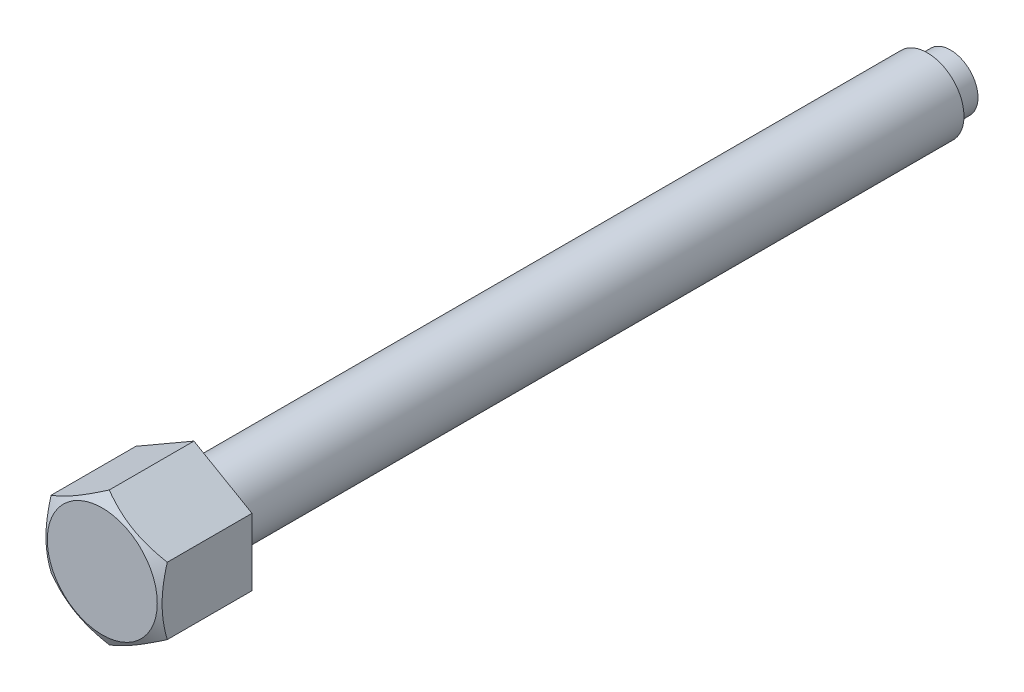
ISO-10303-21;
HEADER;
FILE_DESCRIPTION(('STEP AP214'),'2;1');
FILE_NAME('part.step','',(''),(''),'','','');
FILE_SCHEMA(('AUTOMOTIVE_DESIGN { 1 0 10303 214 1 1 1 1 }'));
ENDSEC;
DATA;
#1=APPLICATION_CONTEXT('core data for automotive mechanical design processes');
#2=APPLICATION_PROTOCOL_DEFINITION('international standard','automotive_design',2000,#1);
#3=PRODUCT_CONTEXT('',#1,'mechanical');
#4=PRODUCT('Part','Part','',(#3));
#5=PRODUCT_RELATED_PRODUCT_CATEGORY('part','',(#4));
#6=PRODUCT_DEFINITION_FORMATION('','',#4);
#7=PRODUCT_DEFINITION_CONTEXT('part definition',#1,'design');
#8=PRODUCT_DEFINITION('design','',#6,#7);
#9=PRODUCT_DEFINITION_SHAPE('','',#8);
#10=(LENGTH_UNIT() NAMED_UNIT(*) SI_UNIT(.MILLI.,.METRE.));
#11=(NAMED_UNIT(*) PLANE_ANGLE_UNIT() SI_UNIT($,.RADIAN.));
#12=(NAMED_UNIT(*) SI_UNIT($,.STERADIAN.) SOLID_ANGLE_UNIT());
#13=UNCERTAINTY_MEASURE_WITH_UNIT(LENGTH_MEASURE(1.E-05),#10,'distance_accuracy_value','');
#14=(GEOMETRIC_REPRESENTATION_CONTEXT(3) GLOBAL_UNCERTAINTY_ASSIGNED_CONTEXT((#13)) GLOBAL_UNIT_ASSIGNED_CONTEXT((#10,
#11,#12)) REPRESENTATION_CONTEXT('',''));
#15=CARTESIAN_POINT('',(0.,0.,0.));
#16=DIRECTION('',(0.,0.,1.));
#17=DIRECTION('',(1.,0.,0.));
#18=AXIS2_PLACEMENT_3D('',#15,#16,#17);
#19=CARTESIAN_POINT('',(0.,10.9696551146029,125.));
#20=DIRECTION('',(-0.5,-0.86602540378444,0.));
#21=DIRECTION('',(0.86602540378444,-0.5,0.));
#22=AXIS2_PLACEMENT_3D('',#19,#20,#21);
#23=PLANE('',#22);
#24=CARTESIAN_POINT('',(9.5002,5.4847120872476,138.862752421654));
#25=CARTESIAN_POINT('',(9.2913692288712,5.60528058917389,138.932351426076));
#26=CARTESIAN_POINT('',(9.08175982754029,5.72629863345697,138.998791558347));
#27=CARTESIAN_POINT('',(8.66086011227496,5.96930519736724,139.124477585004));
#28=CARTESIAN_POINT('',(8.44956926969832,6.09129402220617,139.183721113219));
#29=CARTESIAN_POINT('',(7.81229220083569,6.45922610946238,139.349510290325));
#30=CARTESIAN_POINT('',(7.38379023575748,6.70662183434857,139.443810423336));
#31=CARTESIAN_POINT('',(6.74255666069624,7.0768382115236,139.554386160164));
#32=CARTESIAN_POINT('',(6.53174078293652,7.19855281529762,139.585885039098));
#33=CARTESIAN_POINT('',(6.1091329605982,7.4425455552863,139.638706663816));
#34=CARTESIAN_POINT('',(5.89734099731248,7.5648237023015,139.66002921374));
#35=CARTESIAN_POINT('',(5.47340378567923,7.80958396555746,139.691951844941));
#36=CARTESIAN_POINT('',(5.26125925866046,7.93206566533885,139.702564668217));
#37=CARTESIAN_POINT('',(4.83677424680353,8.17714220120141,139.712842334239));
#38=CARTESIAN_POINT('',(4.62443376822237,8.29973703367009,139.712507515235));
#39=CARTESIAN_POINT('',(4.22745800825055,8.52893109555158,139.701651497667));
#40=CARTESIAN_POINT('',(4.04279470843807,8.63554650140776,139.692454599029));
#41=CARTESIAN_POINT('',(3.67389999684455,8.84852796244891,139.665959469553));
#42=CARTESIAN_POINT('',(3.48966861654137,8.95489399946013,139.648660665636));
#43=CARTESIAN_POINT('',(2.93768832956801,9.27357996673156,139.585020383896));
#44=CARTESIAN_POINT('',(2.57091646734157,9.48533580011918,139.526942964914));
#45=CARTESIAN_POINT('',(1.8334821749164,9.91109368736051,139.381748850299));
#46=CARTESIAN_POINT('',(1.46291385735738,10.1250414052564,139.294016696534));
#47=CARTESIAN_POINT('',(0.727303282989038,10.5497463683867,139.094901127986));
#48=CARTESIAN_POINT('',(0.362251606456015,10.7605090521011,138.98356447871));
#49=CARTESIAN_POINT('',(-0.000199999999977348,10.9697705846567,138.862752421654));
#50=B_SPLINE_CURVE_WITH_KNOTS('',3,(#24,#25,#26,#27,#28,#29,#30,#31,#32,#33,#34,#35,#36,#37,#38,
#39,#40,#41,#42,#43,#44,#45,#46,#47,#48,#49),.UNSPECIFIED.,.F.,.F.,(4,2,2,2,2,2,2,2,2,2,2,2,4),
(0.,0.752880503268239,1.50600787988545,3.01546870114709,3.75167336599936,4.48789219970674,
5.22323407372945,5.95855322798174,6.5986808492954,7.23885375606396,8.52010929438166,
9.82978009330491,11.1368800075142),.UNSPECIFIED.);
#51=CARTESIAN_POINT('',(9.5,5.48482755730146,138.862819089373));
#52=VERTEX_POINT('',#51);
#53=CARTESIAN_POINT('',(0.,10.9696551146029,138.862819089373));
#54=VERTEX_POINT('',#53);
#55=EDGE_CURVE('E29',#52,#54,#50,.T.);
#56=ORIENTED_EDGE('',*,*,#55,.F.);
#57=DIRECTION('',(0.,0.,1.));
#58=VECTOR('',#57,1.);
#59=CARTESIAN_POINT('',(9.5,5.48482755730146,125.));
#60=LINE('',#59,#58);
#61=CARTESIAN_POINT('',(9.5,5.48482755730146,125.));
#62=VERTEX_POINT('',#61);
#63=EDGE_CURVE('E99',#62,#52,#60,.T.);
#64=ORIENTED_EDGE('',*,*,#63,.F.);
#65=DIRECTION('',(0.86602540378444,-0.5,0.));
#66=VECTOR('',#65,1.);
#67=CARTESIAN_POINT('',(0.,10.9696551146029,125.));
#68=LINE('',#67,#66);
#69=CARTESIAN_POINT('',(0.,10.9696551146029,125.));
#70=VERTEX_POINT('',#69);
#71=EDGE_CURVE('E37',#70,#62,#68,.T.);
#72=ORIENTED_EDGE('',*,*,#71,.F.);
#73=DIRECTION('',(0.,0.,1.));
#74=VECTOR('',#73,1.);
#75=CARTESIAN_POINT('',(0.,10.9696551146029,125.));
#76=LINE('',#75,#74);
#77=EDGE_CURVE('E87',#70,#54,#76,.T.);
#78=ORIENTED_EDGE('',*,*,#77,.T.);
#79=EDGE_LOOP('',(#56,#64,#72,#78));
#80=FACE_BOUND('',#79,.T.);
#81=ADVANCED_FACE('F14',(#80),#23,.F.);
#82=CARTESIAN_POINT('',(9.5,5.48482755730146,125.));
#83=DIRECTION('',(-1.,0.,0.));
#84=DIRECTION('',(0.,0.,1.));
#85=AXIS2_PLACEMENT_3D('',#82,#83,#84);
#86=PLANE('',#85);
#87=CARTESIAN_POINT('',(9.5,-14.6851941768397,135.098216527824));
#88=CARTESIAN_POINT('',(9.5,-14.4779337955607,135.198685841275));
#89=CARTESIAN_POINT('',(9.5,-14.270428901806,135.298650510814));
#90=CARTESIAN_POINT('',(9.5,-13.8548790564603,135.497456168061));
#91=CARTESIAN_POINT('',(9.5,-13.6468340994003,135.596297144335));
#92=CARTESIAN_POINT('',(9.5,-13.0217564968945,135.890989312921));
#93=CARTESIAN_POINT('',(9.5,-12.6038431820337,136.084979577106));
#94=CARTESIAN_POINT('',(9.5,-11.7629064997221,136.467870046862));
#95=CARTESIAN_POINT('',(9.5,-11.3398676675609,136.656736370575));
#96=CARTESIAN_POINT('',(9.5,-10.4904091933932,137.026678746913));
#97=CARTESIAN_POINT('',(9.5,-10.0639897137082,137.207755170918));
#98=CARTESIAN_POINT('',(9.5,-9.19352427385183,137.565632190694));
#99=CARTESIAN_POINT('',(9.5,-8.74934746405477,137.742116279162));
#100=CARTESIAN_POINT('',(9.5,-7.85578084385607,138.081611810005));
#101=CARTESIAN_POINT('',(9.5,-7.40639045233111,138.244621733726));
#102=CARTESIAN_POINT('',(9.5,-6.50253282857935,138.552853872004));
#103=CARTESIAN_POINT('',(9.5,-6.04807815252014,138.698112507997));
#104=CARTESIAN_POINT('',(9.5,-5.13266680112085,138.966151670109));
#105=CARTESIAN_POINT('',(9.5,-4.67171223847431,139.088939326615));
#106=CARTESIAN_POINT('',(9.5,-3.74550505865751,139.30545546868));
#107=CARTESIAN_POINT('',(9.5,-3.28028977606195,139.39933932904));
#108=CARTESIAN_POINT('',(9.5,-2.57826896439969,139.514397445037));
#109=CARTESIAN_POINT('',(9.5,-2.34354481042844,139.548457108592));
#110=CARTESIAN_POINT('',(9.5,-1.87294608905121,139.607318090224));
#111=CARTESIAN_POINT('',(9.5,-1.63707163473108,139.632120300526));
#112=CARTESIAN_POINT('',(9.5,-1.16754906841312,139.671663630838));
#113=CARTESIAN_POINT('',(9.5,-0.933911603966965,139.686530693));
#114=CARTESIAN_POINT('',(9.5,-0.46621751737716,139.706374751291));
#115=CARTESIAN_POINT('',(9.5,-0.232160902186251,139.711351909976));
#116=CARTESIAN_POINT('',(9.5,0.235953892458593,139.711297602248));
#117=CARTESIAN_POINT('',(9.5,0.4700120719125,139.706266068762));
#118=CARTESIAN_POINT('',(9.5,0.937709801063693,139.686316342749));
#119=CARTESIAN_POINT('',(9.5,1.17134933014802,139.671397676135));
#120=CARTESIAN_POINT('',(9.5,1.73429887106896,139.623854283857));
#121=CARTESIAN_POINT('',(9.5,2.06321291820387,139.586458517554));
#122=CARTESIAN_POINT('',(9.5,2.71857041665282,139.494120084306));
#123=CARTESIAN_POINT('',(9.5,3.04501352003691,139.439174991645));
#124=CARTESIAN_POINT('',(9.5,3.69512761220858,139.31369254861));
#125=CARTESIAN_POINT('',(9.5,4.01879620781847,139.243142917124));
#126=CARTESIAN_POINT('',(9.5,4.66287230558,139.088601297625));
#127=CARTESIAN_POINT('',(9.5,4.98327986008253,139.004609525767));
#128=CARTESIAN_POINT('',(9.5,5.62787551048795,138.823240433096));
#129=CARTESIAN_POINT('',(9.5,5.95199168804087,138.725609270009));
#130=CARTESIAN_POINT('',(9.5,6.59703046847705,138.520365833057));
#131=CARTESIAN_POINT('',(9.5,6.91795305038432,138.412753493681));
#132=CARTESIAN_POINT('',(9.5,7.55676536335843,138.189247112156));
#133=CARTESIAN_POINT('',(9.5,7.87465608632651,138.073355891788));
#134=CARTESIAN_POINT('',(9.5,8.50781019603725,137.834644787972));
#135=CARTESIAN_POINT('',(9.5,8.82307361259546,137.711824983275));
#136=CARTESIAN_POINT('',(9.5,9.56334321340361,137.415555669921));
#137=CARTESIAN_POINT('',(9.5,9.98737520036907,137.239675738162));
#138=CARTESIAN_POINT('',(9.5,10.8318739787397,136.879531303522));
#139=CARTESIAN_POINT('',(9.5,11.2523405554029,136.69526629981));
#140=CARTESIAN_POINT('',(9.5,12.0903688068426,136.320022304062));
#141=CARTESIAN_POINT('',(9.5,12.5079298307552,136.129041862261));
#142=CARTESIAN_POINT('',(9.5,13.3405386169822,135.741714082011));
#143=CARTESIAN_POINT('',(9.5,13.7555864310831,135.545366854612));
#144=CARTESIAN_POINT('',(9.5,14.5840268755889,135.148091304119));
#145=CARTESIAN_POINT('',(9.5,14.9974172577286,134.94715830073));
#146=CARTESIAN_POINT('',(9.5,15.8224294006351,134.541694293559));
#147=CARTESIAN_POINT('',(9.5,16.2340511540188,134.337163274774));
#148=CARTESIAN_POINT('',(9.5,17.0557451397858,133.925142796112));
#149=CARTESIAN_POINT('',(9.5,17.4658175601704,133.717653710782));
#150=CARTESIAN_POINT('',(9.5,18.2846874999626,133.300173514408));
#151=CARTESIAN_POINT('',(9.5,18.6934850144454,133.090182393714));
#152=CARTESIAN_POINT('',(9.5,19.8503900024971,132.492131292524));
#153=CARTESIAN_POINT('',(9.5,20.5972127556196,132.101586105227));
#154=CARTESIAN_POINT('',(9.5,22.0880928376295,131.315203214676));
#155=CARTESIAN_POINT('',(9.5,22.8321500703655,130.919365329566));
#156=CARTESIAN_POINT('',(9.5,24.3162815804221,130.124602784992));
#157=CARTESIAN_POINT('',(9.5,25.0563611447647,129.725687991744));
#158=CARTESIAN_POINT('',(9.5,26.1651744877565,129.124955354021));
#159=CARTESIAN_POINT('',(9.5,26.5345515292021,128.924323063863));
#160=CARTESIAN_POINT('',(9.5,27.2729193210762,128.522350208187));
#161=CARTESIAN_POINT('',(9.5,27.6419100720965,128.321009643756));
#162=CARTESIAN_POINT('',(9.5,28.0107294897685,128.1193556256));
#163=B_SPLINE_CURVE_WITH_KNOTS('',3,(#87,#88,#89,#90,#91,#92,#93,#94,#95,#96,#97,#98,#99,#100,
#101,#102,#103,#104,#105,#106,#107,#108,#109,#110,#111,#112,#113,#114,#115,#116,#117,#118,#119,
#120,#121,#122,#123,#124,#125,#126,#127,#128,#129,#130,#131,#132,#133,#134,#135,#136,#137,#138,
#139,#140,#141,#142,#143,#144,#145,#146,#147,#148,#149,#150,#151,#152,#153,#154,#155,#156,#157,
#158,#159,#160,#161,#162),.UNSPECIFIED.,.F.,.F.,(4,2,2,2,2,2,2,2,2,2,2,2,2,2,2,2,2,2,2,2,2,2,2,
2,2,2,2,2,2,2,2,2,2,2,2,2,2,4),(0.,0.690982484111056,1.38197199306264,2.76415801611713,
4.15394956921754,5.54367479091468,6.97736618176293,8.41121894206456,9.84207854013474,
11.2724833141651,12.695058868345,13.406452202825,14.1177769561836,14.8199043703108,
15.5220202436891,16.2241408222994,16.9262950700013,17.9188440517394,18.9115302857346,
19.9050005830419,20.8984549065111,21.9137664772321,22.9290847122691,23.944058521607,
24.9590207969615,26.3360812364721,27.7132240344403,29.0906659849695,30.4680794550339,
31.8469678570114,33.22586200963,34.6045830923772,35.9833094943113,38.5116025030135,
41.0399826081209,43.5622046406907,44.8232490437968,46.0842915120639),.UNSPECIFIED.);
#164=CARTESIAN_POINT('',(9.5,-5.48482755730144,138.862819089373));
#165=VERTEX_POINT('',#164);
#166=EDGE_CURVE('E146',#165,#52,#163,.T.);
#167=ORIENTED_EDGE('',*,*,#166,.F.);
#168=DIRECTION('',(0.,0.,1.));
#169=VECTOR('',#168,1.);
#170=CARTESIAN_POINT('',(9.5,-5.48482755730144,125.));
#171=LINE('',#170,#169);
#172=CARTESIAN_POINT('',(9.5,-5.48482755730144,125.));
#173=VERTEX_POINT('',#172);
#174=EDGE_CURVE('E96',#173,#165,#171,.T.);
#175=ORIENTED_EDGE('',*,*,#174,.F.);
#176=DIRECTION('',(0.,-1.,0.));
#177=VECTOR('',#176,1.);
#178=CARTESIAN_POINT('',(9.5,5.48482755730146,125.));
#179=LINE('',#178,#177);
#180=EDGE_CURVE('E161',#62,#173,#179,.T.);
#181=ORIENTED_EDGE('',*,*,#180,.F.);
#182=ORIENTED_EDGE('',*,*,#63,.T.);
#183=EDGE_LOOP('',(#167,#175,#181,#182));
#184=FACE_BOUND('',#183,.T.);
#185=ADVANCED_FACE('F125',(#184),#86,.F.);
#186=CARTESIAN_POINT('',(0.,-10.9696551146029,125.));
#187=DIRECTION('',(0.5,-0.866025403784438,0.));
#188=DIRECTION('',(0.866025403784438,0.5,0.));
#189=AXIS2_PLACEMENT_3D('',#186,#187,#188);
#190=PLANE('',#189);
#191=ORIENTED_EDGE('',*,*,#174,.T.);
#192=CARTESIAN_POINT('',(9.5002,-5.4847120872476,138.862752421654));
#193=CARTESIAN_POINT('',(9.2913692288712,-5.60528058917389,138.932351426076));
#194=CARTESIAN_POINT('',(9.08175982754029,-5.72629863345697,138.998791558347));
#195=CARTESIAN_POINT('',(8.66086011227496,-5.96930519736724,139.124477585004));
#196=CARTESIAN_POINT('',(8.44956926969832,-6.09129402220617,139.183721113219));
#197=CARTESIAN_POINT('',(7.81229220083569,-6.45922610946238,139.349510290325));
#198=CARTESIAN_POINT('',(7.38379023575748,-6.70662183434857,139.443810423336));
#199=CARTESIAN_POINT('',(6.74255666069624,-7.07683821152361,139.554386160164));
#200=CARTESIAN_POINT('',(6.53174078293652,-7.19855281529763,139.585885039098));
#201=CARTESIAN_POINT('',(6.10913296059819,-7.4425455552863,139.638706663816));
#202=CARTESIAN_POINT('',(5.89734099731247,-7.56482370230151,139.66002921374));
#203=CARTESIAN_POINT('',(5.47340378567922,-7.80958396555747,139.691951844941));
#204=CARTESIAN_POINT('',(5.26125925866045,-7.93206566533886,139.702564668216));
#205=CARTESIAN_POINT('',(4.83677424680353,-8.17714220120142,139.712842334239));
#206=CARTESIAN_POINT('',(4.62443376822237,-8.2997370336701,139.712507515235));
#207=CARTESIAN_POINT('',(4.22745800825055,-8.52893109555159,139.701651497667));
#208=CARTESIAN_POINT('',(4.04279470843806,-8.63554650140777,139.692454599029));
#209=CARTESIAN_POINT('',(3.67389999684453,-8.84852796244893,139.665959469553));
#210=CARTESIAN_POINT('',(3.48966861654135,-8.95489399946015,139.648660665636));
#211=CARTESIAN_POINT('',(2.93768832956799,-9.27357996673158,139.585020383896));
#212=CARTESIAN_POINT('',(2.57091646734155,-9.4853358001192,139.526942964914));
#213=CARTESIAN_POINT('',(1.83348217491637,-9.91109368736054,139.381748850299));
#214=CARTESIAN_POINT('',(1.46291385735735,-10.1250414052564,139.294016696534));
#215=CARTESIAN_POINT('',(0.727303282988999,-10.5497463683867,139.094901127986));
#216=CARTESIAN_POINT('',(0.362251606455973,-10.7605090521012,138.98356447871));
#217=CARTESIAN_POINT('',(-0.000200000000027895,-10.9697705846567,138.862752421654));
#218=B_SPLINE_CURVE_WITH_KNOTS('',3,(#192,#193,#194,#195,#196,#197,#198,#199,#200,#201,#202,
#203,#204,#205,#206,#207,#208,#209,#210,#211,#212,#213,#214,#215,#216,#217),.UNSPECIFIED.,.F.,
.F.,(4,2,2,2,2,2,2,2,2,2,2,2,4),(0.,0.75288050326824,1.50600787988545,3.01546870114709,
3.75167336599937,4.48789219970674,5.22323407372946,5.95855322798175,6.59868084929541,
7.23885375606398,8.52010929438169,9.82978009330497,11.1368800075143),.UNSPECIFIED.);
#219=CARTESIAN_POINT('',(0.,-10.9696551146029,138.862819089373));
#220=VERTEX_POINT('',#219);
#221=EDGE_CURVE('E172',#165,#220,#218,.T.);
#222=ORIENTED_EDGE('',*,*,#221,.T.);
#223=DIRECTION('',(0.,0.,1.));
#224=VECTOR('',#223,1.);
#225=CARTESIAN_POINT('',(0.,-10.9696551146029,125.));
#226=LINE('',#225,#224);
#227=CARTESIAN_POINT('',(0.,-10.9696551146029,125.));
#228=VERTEX_POINT('',#227);
#229=EDGE_CURVE('E89',#228,#220,#226,.T.);
#230=ORIENTED_EDGE('',*,*,#229,.F.);
#231=DIRECTION('',(0.866025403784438,0.5,0.));
#232=VECTOR('',#231,1.);
#233=CARTESIAN_POINT('',(0.,-10.9696551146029,125.));
#234=LINE('',#233,#232);
#235=EDGE_CURVE('E158',#228,#173,#234,.T.);
#236=ORIENTED_EDGE('',*,*,#235,.T.);
#237=EDGE_LOOP('',(#191,#222,#230,#236));
#238=FACE_BOUND('',#237,.T.);
#239=ADVANCED_FACE('F130',(#238),#190,.T.);
#240=CARTESIAN_POINT('',(0.,-10.9696551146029,125.));
#241=DIRECTION('',(0.5,0.866025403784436,0.));
#242=DIRECTION('',(-0.866025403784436,0.5,0.));
#243=AXIS2_PLACEMENT_3D('',#240,#241,#242);
#244=PLANE('',#243);
#245=CARTESIAN_POINT('',(-9.5002,-5.48471208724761,138.862752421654));
#246=CARTESIAN_POINT('',(-9.2913692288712,-5.6052805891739,138.932351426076));
#247=CARTESIAN_POINT('',(-9.0817598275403,-5.72629863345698,138.998791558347));
#248=CARTESIAN_POINT('',(-8.66086011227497,-5.96930519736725,139.124477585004));
#249=CARTESIAN_POINT('',(-8.44956926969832,-6.09129402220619,139.183721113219));
#250=CARTESIAN_POINT('',(-7.81229220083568,-6.4592261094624,139.349510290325));
#251=CARTESIAN_POINT('',(-7.38379023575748,-6.70662183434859,139.443810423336));
#252=CARTESIAN_POINT('',(-6.74255666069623,-7.07683821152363,139.554386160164));
#253=CARTESIAN_POINT('',(-6.53174078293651,-7.19855281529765,139.585885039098));
#254=CARTESIAN_POINT('',(-6.10913296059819,-7.44254555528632,139.638706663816));
#255=CARTESIAN_POINT('',(-5.89734099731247,-7.56482370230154,139.66002921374));
#256=CARTESIAN_POINT('',(-5.47340378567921,-7.80958396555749,139.691951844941));
#257=CARTESIAN_POINT('',(-5.26125925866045,-7.93206566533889,139.702564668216));
#258=CARTESIAN_POINT('',(-4.83677424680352,-8.17714220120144,139.712842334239));
#259=CARTESIAN_POINT('',(-4.62443376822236,-8.29973703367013,139.712507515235));
#260=CARTESIAN_POINT('',(-4.22745800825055,-8.52893109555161,139.701651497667));
#261=CARTESIAN_POINT('',(-4.04279470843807,-8.6355465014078,139.692454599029));
#262=CARTESIAN_POINT('',(-3.67389999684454,-8.84852796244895,139.665959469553));
#263=CARTESIAN_POINT('',(-3.48966861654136,-8.95489399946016,139.648660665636));
#264=CARTESIAN_POINT('',(-2.937688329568,-9.2735799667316,139.585020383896));
#265=CARTESIAN_POINT('',(-2.57091646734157,-9.48533580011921,139.526942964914));
#266=CARTESIAN_POINT('',(-1.8334821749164,-9.91109368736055,139.381748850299));
#267=CARTESIAN_POINT('',(-1.46291385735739,-10.1250414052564,139.294016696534));
#268=CARTESIAN_POINT('',(-0.727303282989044,-10.5497463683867,139.094901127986));
#269=CARTESIAN_POINT('',(-0.362251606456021,-10.7605090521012,138.98356447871));
#270=CARTESIAN_POINT('',(0.000199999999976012,-10.9697705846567,138.862752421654));
#271=B_SPLINE_CURVE_WITH_KNOTS('',3,(#245,#246,#247,#248,#249,#250,#251,#252,#253,#254,#255,
#256,#257,#258,#259,#260,#261,#262,#263,#264,#265,#266,#267,#268,#269,#270),.UNSPECIFIED.,.F.,
.F.,(4,2,2,2,2,2,2,2,2,2,2,2,4),(0.,0.752880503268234,1.50600787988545,3.0154687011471,
3.75167336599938,4.48789219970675,5.22323407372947,5.95855322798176,6.59868084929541,
7.23885375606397,8.52010929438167,9.82978009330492,11.1368800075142),.UNSPECIFIED.);
#272=CARTESIAN_POINT('',(-9.5,-5.48482755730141,138.862819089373));
#273=VERTEX_POINT('',#272);
#274=EDGE_CURVE('E81',#273,#220,#271,.T.);
#275=ORIENTED_EDGE('',*,*,#274,.F.);
#276=DIRECTION('',(0.,0.,1.));
#277=VECTOR('',#276,1.);
#278=CARTESIAN_POINT('',(-9.5,-5.48482755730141,125.));
#279=LINE('',#278,#277);
#280=CARTESIAN_POINT('',(-9.5,-5.48482755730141,125.));
#281=VERTEX_POINT('',#280);
#282=EDGE_CURVE('E80',#281,#273,#279,.T.);
#283=ORIENTED_EDGE('',*,*,#282,.F.);
#284=DIRECTION('',(-0.866025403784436,0.5,0.));
#285=VECTOR('',#284,1.);
#286=CARTESIAN_POINT('',(0.,-10.9696551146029,125.));
#287=LINE('',#286,#285);
#288=EDGE_CURVE('E155',#228,#281,#287,.T.);
#289=ORIENTED_EDGE('',*,*,#288,.F.);
#290=ORIENTED_EDGE('',*,*,#229,.T.);
#291=EDGE_LOOP('',(#275,#283,#289,#290));
#292=FACE_BOUND('',#291,.T.);
#293=ADVANCED_FACE('F170',(#292),#244,.F.);
#294=CARTESIAN_POINT('',(-9.5,5.48482755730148,125.));
#295=DIRECTION('',(-1.,0.,0.));
#296=DIRECTION('',(0.,0.,1.));
#297=AXIS2_PLACEMENT_3D('',#294,#295,#296);
#298=PLANE('',#297);
#299=ORIENTED_EDGE('',*,*,#282,.T.);
#300=CARTESIAN_POINT('',(-9.5,-14.6851941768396,135.098216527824));
#301=CARTESIAN_POINT('',(-9.5,-14.4779337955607,135.198685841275));
#302=CARTESIAN_POINT('',(-9.5,-14.270428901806,135.298650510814));
#303=CARTESIAN_POINT('',(-9.5,-13.8548790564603,135.497456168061));
#304=CARTESIAN_POINT('',(-9.5,-13.6468340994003,135.596297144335));
#305=CARTESIAN_POINT('',(-9.5,-13.0217564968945,135.890989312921));
#306=CARTESIAN_POINT('',(-9.5,-12.6038431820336,136.084979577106));
#307=CARTESIAN_POINT('',(-9.5,-11.7629064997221,136.467870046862));
#308=CARTESIAN_POINT('',(-9.5,-11.3398676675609,136.656736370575));
#309=CARTESIAN_POINT('',(-9.5,-10.4904091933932,137.026678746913));
#310=CARTESIAN_POINT('',(-9.5,-10.0639897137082,137.207755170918));
#311=CARTESIAN_POINT('',(-9.5,-9.19352427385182,137.565632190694));
#312=CARTESIAN_POINT('',(-9.5,-8.74934746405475,137.742116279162));
#313=CARTESIAN_POINT('',(-9.5,-7.85578084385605,138.081611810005));
#314=CARTESIAN_POINT('',(-9.5,-7.4063904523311,138.244621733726));
#315=CARTESIAN_POINT('',(-9.5,-6.50253282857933,138.552853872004));
#316=CARTESIAN_POINT('',(-9.5,-6.04807815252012,138.698112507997));
#317=CARTESIAN_POINT('',(-9.5,-5.13266680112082,138.966151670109));
#318=CARTESIAN_POINT('',(-9.5,-4.67171223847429,139.088939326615));
#319=CARTESIAN_POINT('',(-9.5,-3.74550505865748,139.30545546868));
#320=CARTESIAN_POINT('',(-9.5,-3.28028977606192,139.39933932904));
#321=CARTESIAN_POINT('',(-9.5,-2.57826896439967,139.514397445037));
#322=CARTESIAN_POINT('',(-9.5,-2.34354481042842,139.548457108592));
#323=CARTESIAN_POINT('',(-9.5,-1.87294608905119,139.607318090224));
#324=CARTESIAN_POINT('',(-9.5,-1.63707163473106,139.632120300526));
#325=CARTESIAN_POINT('',(-9.5,-1.16754906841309,139.671663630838));
#326=CARTESIAN_POINT('',(-9.5,-0.933911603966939,139.686530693));
#327=CARTESIAN_POINT('',(-9.5,-0.466217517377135,139.706374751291));
#328=CARTESIAN_POINT('',(-9.5,-0.232160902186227,139.711351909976));
#329=CARTESIAN_POINT('',(-9.5,0.235953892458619,139.711297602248));
#330=CARTESIAN_POINT('',(-9.5,0.470012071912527,139.706266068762));
#331=CARTESIAN_POINT('',(-9.5,0.93770980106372,139.686316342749));
#332=CARTESIAN_POINT('',(-9.5,1.17134933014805,139.671397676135));
#333=CARTESIAN_POINT('',(-9.5,1.73429887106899,139.623854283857));
#334=CARTESIAN_POINT('',(-9.5,2.06321291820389,139.586458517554));
#335=CARTESIAN_POINT('',(-9.5,2.71857041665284,139.494120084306));
#336=CARTESIAN_POINT('',(-9.5,3.04501352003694,139.439174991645));
#337=CARTESIAN_POINT('',(-9.5,3.6951276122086,139.31369254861));
#338=CARTESIAN_POINT('',(-9.5,4.01879620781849,139.243142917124));
#339=CARTESIAN_POINT('',(-9.5,4.66287230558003,139.088601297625));
#340=CARTESIAN_POINT('',(-9.5,4.98327986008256,139.004609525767));
#341=CARTESIAN_POINT('',(-9.5,5.62787551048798,138.823240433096));
#342=CARTESIAN_POINT('',(-9.5,5.9519916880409,138.725609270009));
#343=CARTESIAN_POINT('',(-9.5,6.59703046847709,138.520365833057));
#344=CARTESIAN_POINT('',(-9.5,6.91795305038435,138.41275349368));
#345=CARTESIAN_POINT('',(-9.5,7.55676536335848,138.189247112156));
#346=CARTESIAN_POINT('',(-9.5,7.87465608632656,138.073355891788));
#347=CARTESIAN_POINT('',(-9.5,8.50781019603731,137.834644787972));
#348=CARTESIAN_POINT('',(-9.5,8.82307361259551,137.711824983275));
#349=CARTESIAN_POINT('',(-9.5,9.56334321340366,137.415555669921));
#350=CARTESIAN_POINT('',(-9.5,9.98737520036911,137.239675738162));
#351=CARTESIAN_POINT('',(-9.5,10.8318739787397,136.879531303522));
#352=CARTESIAN_POINT('',(-9.5,11.2523405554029,136.69526629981));
#353=CARTESIAN_POINT('',(-9.5,12.0903688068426,136.320022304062));
#354=CARTESIAN_POINT('',(-9.5,12.5079298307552,136.129041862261));
#355=CARTESIAN_POINT('',(-9.5,13.3405386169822,135.741714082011));
#356=CARTESIAN_POINT('',(-9.5,13.7555864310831,135.545366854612));
#357=CARTESIAN_POINT('',(-9.5,14.584026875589,135.148091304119));
#358=CARTESIAN_POINT('',(-9.5,14.9974172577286,134.94715830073));
#359=CARTESIAN_POINT('',(-9.5,15.8224294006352,134.541694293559));
#360=CARTESIAN_POINT('',(-9.5,16.2340511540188,134.337163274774));
#361=CARTESIAN_POINT('',(-9.5,17.0557451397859,133.925142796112));
#362=CARTESIAN_POINT('',(-9.5,17.4658175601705,133.717653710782));
#363=CARTESIAN_POINT('',(-9.5,18.2846874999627,133.300173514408));
#364=CARTESIAN_POINT('',(-9.5,18.6934850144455,133.090182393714));
#365=CARTESIAN_POINT('',(-9.5,19.8503900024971,132.492131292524));
#366=CARTESIAN_POINT('',(-9.5,20.5972127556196,132.101586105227));
#367=CARTESIAN_POINT('',(-9.5,22.0880928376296,131.315203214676));
#368=CARTESIAN_POINT('',(-9.5,22.8321500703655,130.919365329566));
#369=CARTESIAN_POINT('',(-9.5,24.3162815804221,130.124602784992));
#370=CARTESIAN_POINT('',(-9.5,25.0563611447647,129.725687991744));
#371=CARTESIAN_POINT('',(-9.5,26.1651744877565,129.124955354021));
#372=CARTESIAN_POINT('',(-9.5,26.5345515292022,128.924323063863));
#373=CARTESIAN_POINT('',(-9.5,27.2729193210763,128.522350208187));
#374=CARTESIAN_POINT('',(-9.5,27.6419100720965,128.321009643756));
#375=CARTESIAN_POINT('',(-9.5,28.0107294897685,128.1193556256));
#376=B_SPLINE_CURVE_WITH_KNOTS('',3,(#300,#301,#302,#303,#304,#305,#306,#307,#308,#309,#310,
#311,#312,#313,#314,#315,#316,#317,#318,#319,#320,#321,#322,#323,#324,#325,#326,#327,#328,#329,
#330,#331,#332,#333,#334,#335,#336,#337,#338,#339,#340,#341,#342,#343,#344,#345,#346,#347,#348,
#349,#350,#351,#352,#353,#354,#355,#356,#357,#358,#359,#360,#361,#362,#363,#364,#365,#366,#367,
#368,#369,#370,#371,#372,#373,#374,#375),.UNSPECIFIED.,.F.,.F.,(4,2,2,2,2,2,2,2,2,2,2,2,2,2,2,2,
2,2,2,2,2,2,2,2,2,2,2,2,2,2,2,2,2,2,2,2,2,4),(0.,0.690982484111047,1.38197199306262,
2.76415801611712,4.15394956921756,5.54367479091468,6.97736618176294,8.41121894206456,
9.84207854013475,11.2724833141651,12.6950588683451,13.406452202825,14.1177769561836,
14.8199043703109,15.5220202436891,16.2241408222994,16.9262950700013,17.9188440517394,
18.9115302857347,19.905000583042,20.8984549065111,21.9137664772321,22.9290847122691,
23.944058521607,24.9590207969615,26.3360812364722,27.7132240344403,29.0906659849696,
30.468079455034,31.8469678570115,33.22586200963,34.6045830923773,35.9833094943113,
38.5116025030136,41.0399826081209,43.5622046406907,44.8232490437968,46.084291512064),.UNSPECIFIED.);
#377=CARTESIAN_POINT('',(-9.5,5.48482755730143,138.862819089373));
#378=VERTEX_POINT('',#377);
#379=EDGE_CURVE('E68',#273,#378,#376,.T.);
#380=ORIENTED_EDGE('',*,*,#379,.T.);
#381=DIRECTION('',(0.,0.,1.));
#382=VECTOR('',#381,1.);
#383=CARTESIAN_POINT('',(-9.5,5.48482755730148,125.));
#384=LINE('',#383,#382);
#385=CARTESIAN_POINT('',(-9.5,5.48482755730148,125.));
#386=VERTEX_POINT('',#385);
#387=EDGE_CURVE('E78',#386,#378,#384,.T.);
#388=ORIENTED_EDGE('',*,*,#387,.F.);
#389=DIRECTION('',(0.,-1.,0.));
#390=VECTOR('',#389,1.);
#391=CARTESIAN_POINT('',(-9.5,5.48482755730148,125.));
#392=LINE('',#391,#390);
#393=EDGE_CURVE('E153',#386,#281,#392,.T.);
#394=ORIENTED_EDGE('',*,*,#393,.T.);
#395=EDGE_LOOP('',(#299,#380,#388,#394));
#396=FACE_BOUND('',#395,.T.);
#397=ADVANCED_FACE('F76',(#396),#298,.T.);
#398=CARTESIAN_POINT('',(0.,10.9696551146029,125.));
#399=DIRECTION('',(-0.5,0.866025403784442,0.));
#400=DIRECTION('',(-0.866025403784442,-0.5,0.));
#401=AXIS2_PLACEMENT_3D('',#398,#399,#400);
#402=PLANE('',#401);
#403=ORIENTED_EDGE('',*,*,#387,.T.);
#404=CARTESIAN_POINT('',(-9.5002,5.48471208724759,138.862752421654));
#405=CARTESIAN_POINT('',(-9.2913692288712,5.60528058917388,138.932351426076));
#406=CARTESIAN_POINT('',(-9.08175982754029,5.72629863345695,138.998791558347));
#407=CARTESIAN_POINT('',(-8.66086011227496,5.96930519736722,139.124477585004));
#408=CARTESIAN_POINT('',(-8.44956926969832,6.09129402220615,139.183721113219));
#409=CARTESIAN_POINT('',(-7.81229220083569,6.45922610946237,139.349510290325));
#410=CARTESIAN_POINT('',(-7.38379023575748,6.70662183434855,139.443810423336));
#411=CARTESIAN_POINT('',(-6.74255666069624,7.07683821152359,139.554386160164));
#412=CARTESIAN_POINT('',(-6.53174078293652,7.1985528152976,139.585885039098));
#413=CARTESIAN_POINT('',(-6.10913296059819,7.44254555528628,139.638706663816));
#414=CARTESIAN_POINT('',(-5.89734099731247,7.56482370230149,139.66002921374));
#415=CARTESIAN_POINT('',(-5.47340378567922,7.80958396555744,139.691951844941));
#416=CARTESIAN_POINT('',(-5.26125925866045,7.93206566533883,139.702564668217));
#417=CARTESIAN_POINT('',(-4.83677424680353,8.1771422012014,139.712842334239));
#418=CARTESIAN_POINT('',(-4.62443376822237,8.29973703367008,139.712507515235));
#419=CARTESIAN_POINT('',(-4.22745800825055,8.52893109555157,139.701651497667));
#420=CARTESIAN_POINT('',(-4.04279470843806,8.63554650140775,139.692454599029));
#421=CARTESIAN_POINT('',(-3.67389999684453,8.8485279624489,139.665959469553));
#422=CARTESIAN_POINT('',(-3.48966861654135,8.95489399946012,139.648660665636));
#423=CARTESIAN_POINT('',(-2.93768832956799,9.27357996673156,139.585020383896));
#424=CARTESIAN_POINT('',(-2.57091646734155,9.48533580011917,139.526942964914));
#425=CARTESIAN_POINT('',(-1.83348217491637,9.9110936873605,139.381748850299));
#426=CARTESIAN_POINT('',(-1.46291385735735,10.1250414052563,139.294016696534));
#427=CARTESIAN_POINT('',(-0.727303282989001,10.5497463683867,139.094901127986));
#428=CARTESIAN_POINT('',(-0.362251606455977,10.7605090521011,138.98356447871));
#429=CARTESIAN_POINT('',(0.000200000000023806,10.9697705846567,138.862752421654));
#430=B_SPLINE_CURVE_WITH_KNOTS('',3,(#404,#405,#406,#407,#408,#409,#410,#411,#412,#413,#414,
#415,#416,#417,#418,#419,#420,#421,#422,#423,#424,#425,#426,#427,#428,#429),.UNSPECIFIED.,.F.,
.F.,(4,2,2,2,2,2,2,2,2,2,2,2,4),(0.,0.752880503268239,1.50600787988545,3.01546870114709,
3.75167336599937,4.48789219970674,5.22323407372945,5.95855322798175,6.59868084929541,
7.23885375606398,8.52010929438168,9.82978009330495,11.1368800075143),.UNSPECIFIED.);
#431=EDGE_CURVE('E65',#378,#54,#430,.T.);
#432=ORIENTED_EDGE('',*,*,#431,.T.);
#433=ORIENTED_EDGE('',*,*,#77,.F.);
#434=DIRECTION('',(-0.866025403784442,-0.5,0.));
#435=VECTOR('',#434,1.);
#436=CARTESIAN_POINT('',(0.,10.9696551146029,125.));
#437=LINE('',#436,#435);
#438=EDGE_CURVE('E85',#70,#386,#437,.T.);
#439=ORIENTED_EDGE('',*,*,#438,.T.);
#440=EDGE_LOOP('',(#403,#432,#433,#439));
#441=FACE_BOUND('',#440,.T.);
#442=ADVANCED_FACE('F83',(#441),#402,.T.);
#443=CARTESIAN_POINT('',(0.,0.,9.));
#444=DIRECTION('',(0.,0.,1.));
#445=DIRECTION('',(1.,0.,0.));
#446=AXIS2_PLACEMENT_3D('',#443,#444,#445);
#447=SPHERICAL_SURFACE('',#446,9.);
#448=CARTESIAN_POINT('',(0.,0.,1.20577136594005));
#449=DIRECTION('',(0.,0.,1.));
#450=DIRECTION('',(1.,0.,0.));
#451=AXIS2_PLACEMENT_3D('',#448,#449,#450);
#452=CIRCLE('',#451,4.5);
#453=CARTESIAN_POINT('',(4.5,0.,1.20577136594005));
#454=VERTEX_POINT('',#453);
#455=EDGE_CURVE('E9',#454,#454,#452,.T.);
#456=ORIENTED_EDGE('',*,*,#455,.F.);
#457=EDGE_LOOP('',(#456));
#458=FACE_BOUND('',#457,.T.);
#459=ADVANCED_FACE('F16',(#458),#447,.T.);
#460=CARTESIAN_POINT('',(0.,0.,110.));
#461=DIRECTION('',(0.,0.,1.));
#462=DIRECTION('',(1.,0.,0.));
#463=AXIS2_PLACEMENT_3D('',#460,#461,#462);
#464=CYLINDRICAL_SURFACE('',#463,4.5);
#465=ORIENTED_EDGE('',*,*,#455,.T.);
#466=EDGE_LOOP('',(#465));
#467=FACE_BOUND('',#466,.T.);
#468=CARTESIAN_POINT('',(0.,0.,5.));
#469=DIRECTION('',(0.,0.,1.));
#470=DIRECTION('',(1.,0.,0.));
#471=AXIS2_PLACEMENT_3D('',#468,#469,#470);
#472=CIRCLE('',#471,4.5);
#473=CARTESIAN_POINT('',(4.5,0.,5.));
#474=VERTEX_POINT('',#473);
#475=EDGE_CURVE('E22',#474,#474,#472,.T.);
#476=ORIENTED_EDGE('',*,*,#475,.F.);
#477=EDGE_LOOP('',(#476));
#478=FACE_BOUND('',#477,.T.);
#479=ADVANCED_FACE('F112',(#467,#478),#464,.T.);
#480=CARTESIAN_POINT('',(4.5,0.,5.));
#481=DIRECTION('',(0.,0.,1.));
#482=DIRECTION('',(1.,0.,0.));
#483=AXIS2_PLACEMENT_3D('',#480,#481,#482);
#484=PLANE('',#483);
#485=CARTESIAN_POINT('',(0.,0.,5.));
#486=DIRECTION('',(0.,0.,1.));
#487=DIRECTION('',(1.,0.,0.));
#488=AXIS2_PLACEMENT_3D('',#485,#486,#487);
#489=CIRCLE('',#488,6.);
#490=CARTESIAN_POINT('',(6.,0.,5.));
#491=VERTEX_POINT('',#490);
#492=EDGE_CURVE('E105',#491,#491,#489,.T.);
#493=ORIENTED_EDGE('',*,*,#492,.F.);
#494=EDGE_LOOP('',(#493));
#495=FACE_BOUND('',#494,.T.);
#496=ORIENTED_EDGE('',*,*,#475,.T.);
#497=EDGE_LOOP('',(#496));
#498=FACE_BOUND('',#497,.T.);
#499=ADVANCED_FACE('F110',(#495,#498),#484,.F.);
#500=CARTESIAN_POINT('',(0.,0.,110.));
#501=DIRECTION('',(0.,0.,1.));
#502=DIRECTION('',(1.,0.,0.));
#503=AXIS2_PLACEMENT_3D('',#500,#501,#502);
#504=CYLINDRICAL_SURFACE('',#503,6.);
#505=CARTESIAN_POINT('',(0.,0.,125.));
#506=DIRECTION('',(0.,0.,1.));
#507=DIRECTION('',(1.,0.,0.));
#508=AXIS2_PLACEMENT_3D('',#505,#506,#507);
#509=CIRCLE('',#508,6.);
#510=CARTESIAN_POINT('',(6.,0.,125.));
#511=VERTEX_POINT('',#510);
#512=EDGE_CURVE('E102',#511,#511,#509,.T.);
#513=ORIENTED_EDGE('',*,*,#512,.F.);
#514=EDGE_LOOP('',(#513));
#515=FACE_BOUND('',#514,.T.);
#516=ORIENTED_EDGE('',*,*,#492,.T.);
#517=EDGE_LOOP('',(#516));
#518=FACE_BOUND('',#517,.T.);
#519=ADVANCED_FACE('F120',(#515,#518),#504,.T.);
#520=CARTESIAN_POINT('',(6.,0.,125.));
#521=DIRECTION('',(0.,0.,1.));
#522=DIRECTION('',(1.,0.,0.));
#523=AXIS2_PLACEMENT_3D('',#520,#521,#522);
#524=PLANE('',#523);
#525=ORIENTED_EDGE('',*,*,#438,.F.);
#526=ORIENTED_EDGE('',*,*,#71,.T.);
#527=ORIENTED_EDGE('',*,*,#180,.T.);
#528=ORIENTED_EDGE('',*,*,#235,.F.);
#529=ORIENTED_EDGE('',*,*,#288,.T.);
#530=ORIENTED_EDGE('',*,*,#393,.F.);
#531=EDGE_LOOP('',(#525,#526,#527,#528,#529,#530));
#532=FACE_BOUND('',#531,.T.);
#533=ORIENTED_EDGE('',*,*,#512,.T.);
#534=EDGE_LOOP('',(#533));
#535=FACE_BOUND('',#534,.T.);
#536=ADVANCED_FACE('F164',(#532,#535),#524,.F.);
#537=CARTESIAN_POINT('',(0.,0.,140.));
#538=DIRECTION('',(0.,0.,-1.));
#539=DIRECTION('',(-1.,0.,0.));
#540=AXIS2_PLACEMENT_3D('',#537,#538,#539);
#541=CONICAL_SURFACE('',#540,9.,1.0471975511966);
#542=CARTESIAN_POINT('',(0.,0.,140.));
#543=DIRECTION('',(0.,0.,1.));
#544=DIRECTION('',(1.,0.,0.));
#545=AXIS2_PLACEMENT_3D('',#542,#543,#544);
#546=CIRCLE('',#545,9.);
#547=CARTESIAN_POINT('',(9.,0.,140.));
#548=VERTEX_POINT('',#547);
#549=EDGE_CURVE('E72',#548,#548,#546,.T.);
#550=ORIENTED_EDGE('',*,*,#549,.F.);
#551=EDGE_LOOP('',(#550));
#552=FACE_BOUND('',#551,.T.);
#553=ORIENTED_EDGE('',*,*,#55,.T.);
#554=ORIENTED_EDGE('',*,*,#431,.F.);
#555=ORIENTED_EDGE('',*,*,#379,.F.);
#556=ORIENTED_EDGE('',*,*,#274,.T.);
#557=ORIENTED_EDGE('',*,*,#221,.F.);
#558=ORIENTED_EDGE('',*,*,#166,.T.);
#559=EDGE_LOOP('',(#553,#554,#555,#556,#557,#558));
#560=FACE_BOUND('',#559,.T.);
#561=ADVANCED_FACE('F67',(#552,#560),#541,.T.);
#562=CARTESIAN_POINT('',(0.,0.,140.));
#563=DIRECTION('',(0.,0.,1.));
#564=DIRECTION('',(1.,0.,0.));
#565=AXIS2_PLACEMENT_3D('',#562,#563,#564);
#566=PLANE('',#565);
#567=ORIENTED_EDGE('',*,*,#549,.T.);
#568=EDGE_LOOP('',(#567));
#569=FACE_BOUND('',#568,.T.);
#570=ADVANCED_FACE('F196',(#569),#566,.T.);
#571=CLOSED_SHELL('',(#81,#185,#239,#293,#397,#442,#459,#479,#499,#519,#536,#561,#570));
#572=MANIFOLD_SOLID_BREP('B1',#571);
#573=ADVANCED_BREP_SHAPE_REPRESENTATION('',(#18,#572),#14);
#574=SHAPE_DEFINITION_REPRESENTATION(#9,#573);
ENDSEC;
END-ISO-10303-21;
